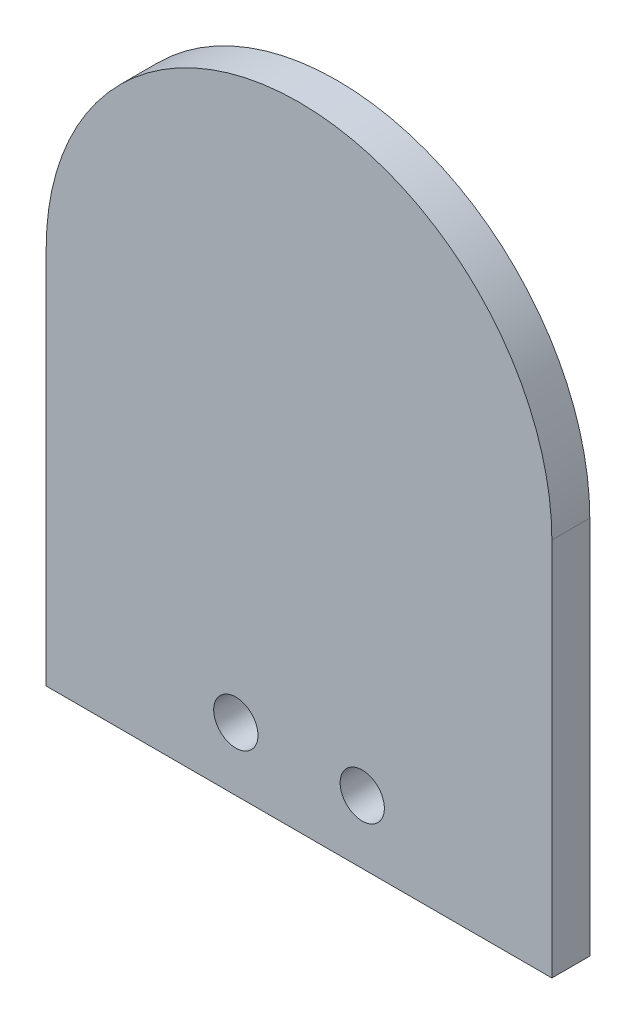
ISO-10303-21;
HEADER;
FILE_DESCRIPTION(('STEP AP214'),'2;1');
FILE_NAME('part.step','',(''),(''),'','','');
FILE_SCHEMA(('AUTOMOTIVE_DESIGN { 1 0 10303 214 1 1 1 1 }'));
ENDSEC;
DATA;
#1=APPLICATION_CONTEXT('core data for automotive mechanical design processes');
#2=APPLICATION_PROTOCOL_DEFINITION('international standard','automotive_design',2000,#1);
#3=PRODUCT_CONTEXT('',#1,'mechanical');
#4=PRODUCT('Part','Part','',(#3));
#5=PRODUCT_RELATED_PRODUCT_CATEGORY('part','',(#4));
#6=PRODUCT_DEFINITION_FORMATION('','',#4);
#7=PRODUCT_DEFINITION_CONTEXT('part definition',#1,'design');
#8=PRODUCT_DEFINITION('design','',#6,#7);
#9=PRODUCT_DEFINITION_SHAPE('','',#8);
#10=(LENGTH_UNIT() NAMED_UNIT(*) SI_UNIT(.MILLI.,.METRE.));
#11=(NAMED_UNIT(*) PLANE_ANGLE_UNIT() SI_UNIT($,.RADIAN.));
#12=(NAMED_UNIT(*) SI_UNIT($,.STERADIAN.) SOLID_ANGLE_UNIT());
#13=UNCERTAINTY_MEASURE_WITH_UNIT(LENGTH_MEASURE(1.E-05),#10,'distance_accuracy_value','');
#14=(GEOMETRIC_REPRESENTATION_CONTEXT(3) GLOBAL_UNCERTAINTY_ASSIGNED_CONTEXT((#13)) GLOBAL_UNIT_ASSIGNED_CONTEXT((#10,
#11,#12)) REPRESENTATION_CONTEXT('',''));
#15=CARTESIAN_POINT('',(0.,0.,0.));
#16=DIRECTION('',(0.,0.,1.));
#17=DIRECTION('',(1.,0.,0.));
#18=AXIS2_PLACEMENT_3D('',#15,#16,#17);
#19=CARTESIAN_POINT('',(20.,30.,3.));
#20=DIRECTION('',(0.,0.,1.));
#21=DIRECTION('',(1.,0.,0.));
#22=AXIS2_PLACEMENT_3D('',#19,#20,#21);
#23=PLANE('',#22);
#24=CARTESIAN_POINT('',(15.,5.,3.));
#25=DIRECTION('',(0.,0.,1.));
#26=DIRECTION('',(1.,0.,0.));
#27=AXIS2_PLACEMENT_3D('',#24,#25,#26);
#28=CIRCLE('',#27,1.75);
#29=CARTESIAN_POINT('',(16.75,5.,3.));
#30=VERTEX_POINT('',#29);
#31=EDGE_CURVE('E98',#30,#30,#28,.T.);
#32=ORIENTED_EDGE('',*,*,#31,.F.);
#33=EDGE_LOOP('',(#32));
#34=FACE_BOUND('',#33,.T.);
#35=DIRECTION('',(0.,-1.,0.));
#36=VECTOR('',#35,1.);
#37=CARTESIAN_POINT('',(0.,0.,3.));
#38=LINE('',#37,#36);
#39=CARTESIAN_POINT('',(0.,30.,3.));
#40=VERTEX_POINT('',#39);
#41=CARTESIAN_POINT('',(0.,0.,3.));
#42=VERTEX_POINT('',#41);
#43=EDGE_CURVE('E83',#40,#42,#38,.T.);
#44=ORIENTED_EDGE('',*,*,#43,.T.);
#45=DIRECTION('',(1.,0.,0.));
#46=VECTOR('',#45,1.);
#47=CARTESIAN_POINT('',(0.,0.,3.));
#48=LINE('',#47,#46);
#49=CARTESIAN_POINT('',(40.,0.,3.));
#50=VERTEX_POINT('',#49);
#51=EDGE_CURVE('E78',#42,#50,#48,.T.);
#52=ORIENTED_EDGE('',*,*,#51,.T.);
#53=DIRECTION('',(0.,1.,0.));
#54=VECTOR('',#53,1.);
#55=CARTESIAN_POINT('',(40.,0.,3.));
#56=LINE('',#55,#54);
#57=CARTESIAN_POINT('',(40.,30.,3.));
#58=VERTEX_POINT('',#57);
#59=EDGE_CURVE('E81',#50,#58,#56,.T.);
#60=ORIENTED_EDGE('',*,*,#59,.T.);
#61=CARTESIAN_POINT('',(20.,30.,3.));
#62=DIRECTION('',(0.,0.,1.));
#63=DIRECTION('',(1.,0.,0.));
#64=AXIS2_PLACEMENT_3D('',#61,#62,#63);
#65=CIRCLE('',#64,20.);
#66=EDGE_CURVE('E48',#58,#40,#65,.T.);
#67=ORIENTED_EDGE('',*,*,#66,.T.);
#68=EDGE_LOOP('',(#44,#52,#60,#67));
#69=FACE_BOUND('',#68,.T.);
#70=CARTESIAN_POINT('',(25.,5.,3.));
#71=DIRECTION('',(0.,0.,1.));
#72=DIRECTION('',(1.,0.,0.));
#73=AXIS2_PLACEMENT_3D('',#70,#71,#72);
#74=CIRCLE('',#73,1.75);
#75=CARTESIAN_POINT('',(26.75,5.,3.));
#76=VERTEX_POINT('',#75);
#77=EDGE_CURVE('E113',#76,#76,#74,.T.);
#78=ORIENTED_EDGE('',*,*,#77,.F.);
#79=EDGE_LOOP('',(#78));
#80=FACE_BOUND('',#79,.T.);
#81=ADVANCED_FACE('F31',(#34,#69,#80),#23,.T.);
#82=CARTESIAN_POINT('',(20.,30.,0.));
#83=DIRECTION('',(0.,0.,1.));
#84=DIRECTION('',(1.,0.,0.));
#85=AXIS2_PLACEMENT_3D('',#82,#83,#84);
#86=PLANE('',#85);
#87=CARTESIAN_POINT('',(15.,5.,0.));
#88=DIRECTION('',(0.,0.,1.));
#89=DIRECTION('',(1.,0.,0.));
#90=AXIS2_PLACEMENT_3D('',#87,#88,#89);
#91=CIRCLE('',#90,1.75);
#92=CARTESIAN_POINT('',(16.75,5.,0.));
#93=VERTEX_POINT('',#92);
#94=EDGE_CURVE('E110',#93,#93,#91,.T.);
#95=ORIENTED_EDGE('',*,*,#94,.T.);
#96=EDGE_LOOP('',(#95));
#97=FACE_BOUND('',#96,.T.);
#98=DIRECTION('',(0.,-1.,0.));
#99=VECTOR('',#98,1.);
#100=CARTESIAN_POINT('',(0.,0.,0.));
#101=LINE('',#100,#99);
#102=CARTESIAN_POINT('',(0.,30.,0.));
#103=VERTEX_POINT('',#102);
#104=CARTESIAN_POINT('',(0.,0.,0.));
#105=VERTEX_POINT('',#104);
#106=EDGE_CURVE('E95',#103,#105,#101,.T.);
#107=ORIENTED_EDGE('',*,*,#106,.F.);
#108=CARTESIAN_POINT('',(20.,30.,0.));
#109=DIRECTION('',(0.,0.,1.));
#110=DIRECTION('',(1.,0.,0.));
#111=AXIS2_PLACEMENT_3D('',#108,#109,#110);
#112=CIRCLE('',#111,20.);
#113=CARTESIAN_POINT('',(40.,30.,0.));
#114=VERTEX_POINT('',#113);
#115=EDGE_CURVE('E71',#114,#103,#112,.T.);
#116=ORIENTED_EDGE('',*,*,#115,.F.);
#117=DIRECTION('',(0.,1.,0.));
#118=VECTOR('',#117,1.);
#119=CARTESIAN_POINT('',(40.,0.,0.));
#120=LINE('',#119,#118);
#121=CARTESIAN_POINT('',(40.,0.,0.));
#122=VERTEX_POINT('',#121);
#123=EDGE_CURVE('E65',#122,#114,#120,.T.);
#124=ORIENTED_EDGE('',*,*,#123,.F.);
#125=DIRECTION('',(1.,0.,0.));
#126=VECTOR('',#125,1.);
#127=CARTESIAN_POINT('',(0.,0.,0.));
#128=LINE('',#127,#126);
#129=EDGE_CURVE('E87',#105,#122,#128,.T.);
#130=ORIENTED_EDGE('',*,*,#129,.F.);
#131=EDGE_LOOP('',(#107,#116,#124,#130));
#132=FACE_BOUND('',#131,.T.);
#133=CARTESIAN_POINT('',(25.,5.,0.));
#134=DIRECTION('',(0.,0.,1.));
#135=DIRECTION('',(1.,0.,0.));
#136=AXIS2_PLACEMENT_3D('',#133,#134,#135);
#137=CIRCLE('',#136,1.75);
#138=CARTESIAN_POINT('',(26.75,5.,0.));
#139=VERTEX_POINT('',#138);
#140=EDGE_CURVE('E116',#139,#139,#137,.T.);
#141=ORIENTED_EDGE('',*,*,#140,.T.);
#142=EDGE_LOOP('',(#141));
#143=FACE_BOUND('',#142,.T.);
#144=ADVANCED_FACE('F106',(#97,#132,#143),#86,.F.);
#145=CARTESIAN_POINT('',(0.,0.,3.));
#146=DIRECTION('',(1.,0.,0.));
#147=DIRECTION('',(0.,0.,-1.));
#148=AXIS2_PLACEMENT_3D('',#145,#146,#147);
#149=PLANE('',#148);
#150=ORIENTED_EDGE('',*,*,#106,.T.);
#151=DIRECTION('',(0.,0.,-1.));
#152=VECTOR('',#151,1.);
#153=CARTESIAN_POINT('',(0.,0.,3.));
#154=LINE('',#153,#152);
#155=EDGE_CURVE('E11',#42,#105,#154,.T.);
#156=ORIENTED_EDGE('',*,*,#155,.F.);
#157=ORIENTED_EDGE('',*,*,#43,.F.);
#158=DIRECTION('',(0.,0.,-1.));
#159=VECTOR('',#158,1.);
#160=CARTESIAN_POINT('',(0.,30.,3.));
#161=LINE('',#160,#159);
#162=EDGE_CURVE('E91',#40,#103,#161,.T.);
#163=ORIENTED_EDGE('',*,*,#162,.T.);
#164=EDGE_LOOP('',(#150,#156,#157,#163));
#165=FACE_BOUND('',#164,.T.);
#166=ADVANCED_FACE('F33',(#165),#149,.F.);
#167=CARTESIAN_POINT('',(0.,0.,3.));
#168=DIRECTION('',(0.,1.,0.));
#169=DIRECTION('',(0.,0.,1.));
#170=AXIS2_PLACEMENT_3D('',#167,#168,#169);
#171=PLANE('',#170);
#172=ORIENTED_EDGE('',*,*,#129,.T.);
#173=DIRECTION('',(0.,0.,-1.));
#174=VECTOR('',#173,1.);
#175=CARTESIAN_POINT('',(40.,0.,3.));
#176=LINE('',#175,#174);
#177=EDGE_CURVE('E40',#50,#122,#176,.T.);
#178=ORIENTED_EDGE('',*,*,#177,.F.);
#179=ORIENTED_EDGE('',*,*,#51,.F.);
#180=ORIENTED_EDGE('',*,*,#155,.T.);
#181=EDGE_LOOP('',(#172,#178,#179,#180));
#182=FACE_BOUND('',#181,.T.);
#183=ADVANCED_FACE('F86',(#182),#171,.F.);
#184=CARTESIAN_POINT('',(40.,0.,3.));
#185=DIRECTION('',(-1.,0.,0.));
#186=DIRECTION('',(0.,0.,1.));
#187=AXIS2_PLACEMENT_3D('',#184,#185,#186);
#188=PLANE('',#187);
#189=ORIENTED_EDGE('',*,*,#123,.T.);
#190=DIRECTION('',(0.,0.,-1.));
#191=VECTOR('',#190,1.);
#192=CARTESIAN_POINT('',(40.,30.,3.));
#193=LINE('',#192,#191);
#194=EDGE_CURVE('E88',#58,#114,#193,.T.);
#195=ORIENTED_EDGE('',*,*,#194,.F.);
#196=ORIENTED_EDGE('',*,*,#59,.F.);
#197=ORIENTED_EDGE('',*,*,#177,.T.);
#198=EDGE_LOOP('',(#189,#195,#196,#197));
#199=FACE_BOUND('',#198,.T.);
#200=ADVANCED_FACE('F89',(#199),#188,.F.);
#201=CARTESIAN_POINT('',(20.,30.,3.));
#202=DIRECTION('',(0.,0.,-1.));
#203=DIRECTION('',(-1.,0.,0.));
#204=AXIS2_PLACEMENT_3D('',#201,#202,#203);
#205=CYLINDRICAL_SURFACE('',#204,20.);
#206=ORIENTED_EDGE('',*,*,#115,.T.);
#207=ORIENTED_EDGE('',*,*,#162,.F.);
#208=ORIENTED_EDGE('',*,*,#66,.F.);
#209=ORIENTED_EDGE('',*,*,#194,.T.);
#210=EDGE_LOOP('',(#206,#207,#208,#209));
#211=FACE_BOUND('',#210,.T.);
#212=ADVANCED_FACE('F103',(#211),#205,.T.);
#213=CARTESIAN_POINT('',(15.,5.,3.));
#214=DIRECTION('',(0.,0.,-1.));
#215=DIRECTION('',(-1.,0.,0.));
#216=AXIS2_PLACEMENT_3D('',#213,#214,#215);
#217=CYLINDRICAL_SURFACE('',#216,1.75);
#218=ORIENTED_EDGE('',*,*,#31,.T.);
#219=EDGE_LOOP('',(#218));
#220=FACE_BOUND('',#219,.T.);
#221=ORIENTED_EDGE('',*,*,#94,.F.);
#222=EDGE_LOOP('',(#221));
#223=FACE_BOUND('',#222,.T.);
#224=ADVANCED_FACE('F134',(#220,#223),#217,.F.);
#225=CARTESIAN_POINT('',(25.,5.,3.));
#226=DIRECTION('',(0.,0.,-1.));
#227=DIRECTION('',(-1.,0.,0.));
#228=AXIS2_PLACEMENT_3D('',#225,#226,#227);
#229=CYLINDRICAL_SURFACE('',#228,1.75);
#230=ORIENTED_EDGE('',*,*,#77,.T.);
#231=EDGE_LOOP('',(#230));
#232=FACE_BOUND('',#231,.T.);
#233=ORIENTED_EDGE('',*,*,#140,.F.);
#234=EDGE_LOOP('',(#233));
#235=FACE_BOUND('',#234,.T.);
#236=ADVANCED_FACE('F122',(#232,#235),#229,.F.);
#237=CLOSED_SHELL('',(#81,#144,#166,#183,#200,#212,#224,#236));
#238=MANIFOLD_SOLID_BREP('B2',#237);
#239=ADVANCED_BREP_SHAPE_REPRESENTATION('',(#18,#238),#14);
#240=SHAPE_DEFINITION_REPRESENTATION(#9,#239);
ENDSEC;
END-ISO-10303-21;
